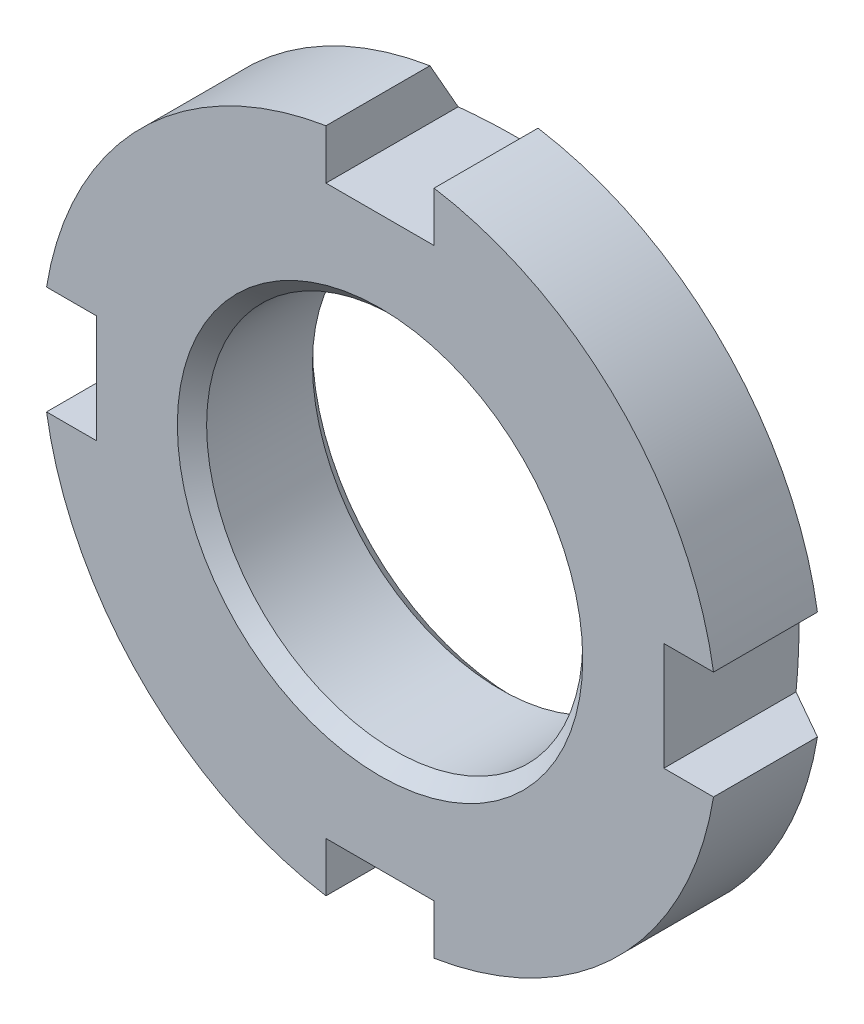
from build123d import *

# Parameters (mm, degrees)
SKETCH2_R          = 25
CUT_EXTRUDE1_DEPTH = 5


with BuildPart() as part:
    # Sketch1 → Revolve1 (revolve)
    with BuildSketch(Plane(origin=(0, 0, 0), x_dir=(0, 0, -1), z_dir=(1, 0, 0)), mode=Mode.PRIVATE) as revolve1_sk:
        Polygon((0, 12.5), (0, 7.5), (0.5415, 6.9585), (4.4585, 6.9585), (5, 7.5), (5, 10.5), (3.845299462, 12.5), align=None)
    revolve(revolve1_sk.sketch.rotate(Axis((0, 0, -5), (0, 0, 1)), 270), axis=Axis((0, 0, -5), (0, 0, 1)))

    # Sketch2 → Cut-Extrude1 (cut)
    with BuildSketch(Plane.XY):
        Circle(SKETCH2_R)
        with BuildLine():
            Line((-19.126486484, 2), (-10.5, 2))
            Line((-10.5, 2), (-10.5, -2))
            Line((-10.5, -2), (-19.126486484, -2))
            ThreePointArc((-19.126486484, -2), (-13.598207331, -13.598207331), (-2, -19.126486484))
            Line((-2, -19.126486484), (-2, -10.5))
            Line((-2, -10.5), (2, -10.5))
            Line((2, -10.5), (2, -19.126486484))
            ThreePointArc((2, -19.126486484), (13.598207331, -13.598207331), (19.126486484, -2))
            Line((19.126486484, -2), (10.5, -2))
            Line((10.5, -2), (10.5, 2))
            Line((10.5, 2), (19.126486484, 2))
            ThreePointArc((19.126486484, 2), (13.598207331, 13.598207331), (2, 19.126486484))
            Line((2, 19.126486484), (2, 10.5))
            Line((2, 10.5), (-2, 10.5))
            Line((-2, 10.5), (-2, 19.126486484))
            ThreePointArc((-2, 19.126486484), (-13.598207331, 13.598207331), (-19.126486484, 2))
        make_face(mode=Mode.SUBTRACT)
    extrude(amount=-CUT_EXTRUDE1_DEPTH, mode=Mode.SUBTRACT)


solid = part.part
